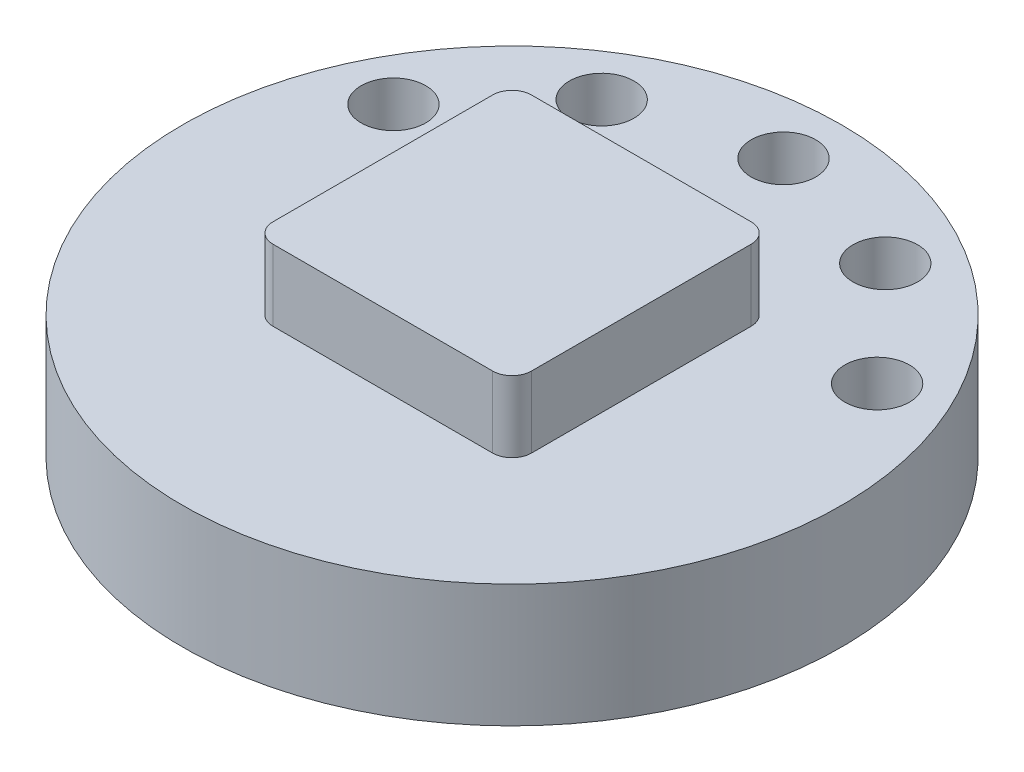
from build123d import *

# Parameters (mm, degrees)
SKIZZE1_R                       = 5.1
SKIZZE1_R_2                     = 0.5
AUFSATZ_LINEAR_AUSTRAGEN1_DEPTH = 1.9
SKIZZE2_W                       = 4
SKIZZE2_H                       = 4
AUFSATZ_LINEAR_AUSTRAGEN2_DEPTH = 1.1
VERRUNDUNG1_R                   = 0.3


with BuildPart() as part:
    # Skizze1 → Aufsatz-Linear austragen1 (new body)
    with BuildSketch(Plane(origin=(0, 0, 0), x_dir=(1, 0, 0), z_dir=(0, 1, 0))):
        with Locations(Location((0, 0, 0), (0, 0, 90))):
            Circle(SKIZZE1_R)
        with Locations(Location((0, 4.2, 0), (0, 0, 270))):
            Circle(SKIZZE1_R_2, mode=Mode.SUBTRACT)
        with Locations(Location((2.194493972, 3.58108869, 0), (0, 0, 270))):
            Circle(SKIZZE1_R_2, mode=Mode.SUBTRACT)
        with Locations(Location((3.742227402, 1.906760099, 0), (0, 0, 270))):
            Circle(SKIZZE1_R_2, mode=Mode.SUBTRACT)
        with Locations(Location((-3.742227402, 1.906760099, 0), (0, 0, 90))):
            Circle(SKIZZE1_R_2, mode=Mode.SUBTRACT)
        with Locations(Location((-2.194493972, 3.58108869, 0), (0, 0, 90))):
            Circle(SKIZZE1_R_2, mode=Mode.SUBTRACT)
    extrude(amount=AUFSATZ_LINEAR_AUSTRAGEN1_DEPTH)

    # Skizze2 → Aufsatz-Linear austragen2 (add)
    with BuildSketch(Plane(origin=(0, 1.9, 0), x_dir=(1, 0, 0), z_dir=(0, 1, 0))):
        Rectangle(SKIZZE2_W, SKIZZE2_H)
    extrude(amount=AUFSATZ_LINEAR_AUSTRAGEN2_DEPTH)

    # Verrundung1
    verrundung1_edges = [part.edges().sort_by_distance(p)[0] for p in [
        (2, 2.45, 2),
        (2, 2.45, -2),
        (-2, 2.45, -2),
        (-2, 2.45, 2),
    ]]
    fillet(verrundung1_edges, radius=VERRUNDUNG1_R)


solid = part.part
